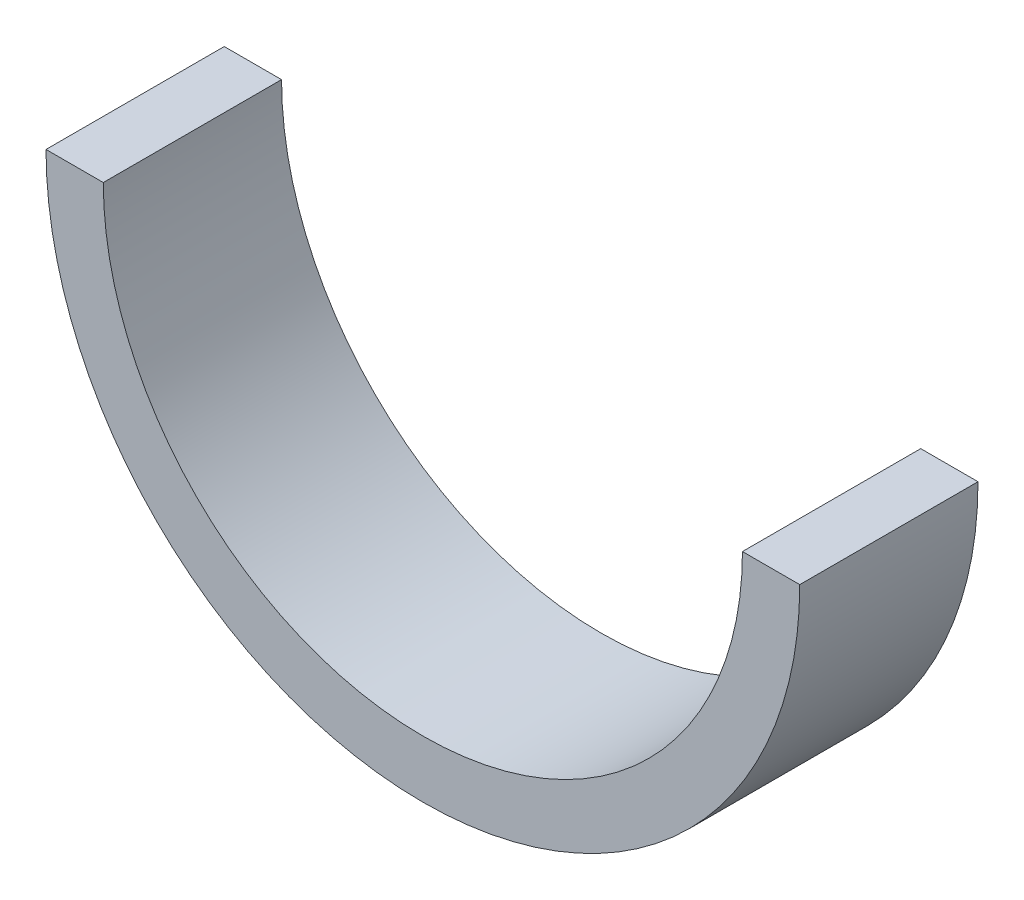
ISO-10303-21;
HEADER;
FILE_DESCRIPTION(('STEP AP214'),'2;1');
FILE_NAME('part.step','',(''),(''),'','','');
FILE_SCHEMA(('AUTOMOTIVE_DESIGN { 1 0 10303 214 1 1 1 1 }'));
ENDSEC;
DATA;
#1=APPLICATION_CONTEXT('core data for automotive mechanical design processes');
#2=APPLICATION_PROTOCOL_DEFINITION('international standard','automotive_design',2000,#1);
#3=PRODUCT_CONTEXT('',#1,'mechanical');
#4=PRODUCT('Part','Part','',(#3));
#5=PRODUCT_RELATED_PRODUCT_CATEGORY('part','',(#4));
#6=PRODUCT_DEFINITION_FORMATION('','',#4);
#7=PRODUCT_DEFINITION_CONTEXT('part definition',#1,'design');
#8=PRODUCT_DEFINITION('design','',#6,#7);
#9=PRODUCT_DEFINITION_SHAPE('','',#8);
#10=(LENGTH_UNIT() NAMED_UNIT(*) SI_UNIT(.MILLI.,.METRE.));
#11=(NAMED_UNIT(*) PLANE_ANGLE_UNIT() SI_UNIT($,.RADIAN.));
#12=(NAMED_UNIT(*) SI_UNIT($,.STERADIAN.) SOLID_ANGLE_UNIT());
#13=UNCERTAINTY_MEASURE_WITH_UNIT(LENGTH_MEASURE(1.E-05),#10,'distance_accuracy_value','');
#14=(GEOMETRIC_REPRESENTATION_CONTEXT(3) GLOBAL_UNCERTAINTY_ASSIGNED_CONTEXT((#13)) GLOBAL_UNIT_ASSIGNED_CONTEXT((#10,
#11,#12)) REPRESENTATION_CONTEXT('',''));
#15=CARTESIAN_POINT('',(0.,0.,0.));
#16=DIRECTION('',(0.,0.,1.));
#17=DIRECTION('',(1.,0.,0.));
#18=AXIS2_PLACEMENT_3D('',#15,#16,#17);
#19=CARTESIAN_POINT('',(0.,0.,0.));
#20=DIRECTION('',(0.,0.,-1.));
#21=DIRECTION('',(-1.,0.,0.));
#22=AXIS2_PLACEMENT_3D('',#19,#20,#21);
#23=CYLINDRICAL_SURFACE('',#22,12.55);
#24=CARTESIAN_POINT('',(0.,0.,0.));
#25=DIRECTION('',(0.,0.,1.));
#26=DIRECTION('',(-1.,0.,0.));
#27=AXIS2_PLACEMENT_3D('',#24,#25,#26);
#28=CIRCLE('',#27,12.55);
#29=CARTESIAN_POINT('',(-12.55,0.,0.));
#30=VERTEX_POINT('',#29);
#31=CARTESIAN_POINT('',(12.55,-3.423379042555E-13,0.));
#32=VERTEX_POINT('',#31);
#33=EDGE_CURVE('E105',#30,#32,#28,.T.);
#34=ORIENTED_EDGE('',*,*,#33,.F.);
#35=DIRECTION('',(0.,0.,1.));
#36=VECTOR('',#35,1.);
#37=CARTESIAN_POINT('',(-12.55,0.,0.));
#38=LINE('',#37,#36);
#39=CARTESIAN_POINT('',(-12.55,0.,7.));
#40=VERTEX_POINT('',#39);
#41=EDGE_CURVE('E10',#30,#40,#38,.T.);
#42=ORIENTED_EDGE('',*,*,#41,.T.);
#43=CARTESIAN_POINT('',(0.,0.,7.));
#44=DIRECTION('',(0.,0.,1.));
#45=DIRECTION('',(-1.,0.,0.));
#46=AXIS2_PLACEMENT_3D('',#43,#44,#45);
#47=CIRCLE('',#46,12.55);
#48=CARTESIAN_POINT('',(12.55,-3.423379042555E-13,7.));
#49=VERTEX_POINT('',#48);
#50=EDGE_CURVE('E24',#40,#49,#47,.T.);
#51=ORIENTED_EDGE('',*,*,#50,.T.);
#52=DIRECTION('',(0.,0.,-1.));
#53=VECTOR('',#52,1.);
#54=CARTESIAN_POINT('',(12.55,0.,0.));
#55=LINE('',#54,#53);
#56=EDGE_CURVE('E71',#49,#32,#55,.T.);
#57=ORIENTED_EDGE('',*,*,#56,.T.);
#58=EDGE_LOOP('',(#34,#42,#51,#57));
#59=FACE_BOUND('',#58,.T.);
#60=ADVANCED_FACE('F16',(#59),#23,.F.);
#61=CARTESIAN_POINT('',(20.,0.,0.));
#62=DIRECTION('',(0.,-1.,0.));
#63=DIRECTION('',(-1.,0.,0.));
#64=AXIS2_PLACEMENT_3D('',#61,#62,#63);
#65=PLANE('',#64);
#66=DIRECTION('',(0.,0.,1.));
#67=VECTOR('',#66,1.);
#68=CARTESIAN_POINT('',(-14.8,0.,0.));
#69=LINE('',#68,#67);
#70=CARTESIAN_POINT('',(-14.8,0.,0.));
#71=VERTEX_POINT('',#70);
#72=CARTESIAN_POINT('',(-14.8,0.,7.));
#73=VERTEX_POINT('',#72);
#74=EDGE_CURVE('E88',#71,#73,#69,.T.);
#75=ORIENTED_EDGE('',*,*,#74,.T.);
#76=DIRECTION('',(-1.,0.,0.));
#77=VECTOR('',#76,1.);
#78=CARTESIAN_POINT('',(20.,0.,7.));
#79=LINE('',#78,#77);
#80=EDGE_CURVE('E81',#40,#73,#79,.T.);
#81=ORIENTED_EDGE('',*,*,#80,.F.);
#82=ORIENTED_EDGE('',*,*,#41,.F.);
#83=DIRECTION('',(-1.,0.,0.));
#84=VECTOR('',#83,1.);
#85=CARTESIAN_POINT('',(20.,0.,0.));
#86=LINE('',#85,#84);
#87=EDGE_CURVE('E74',#30,#71,#86,.T.);
#88=ORIENTED_EDGE('',*,*,#87,.T.);
#89=EDGE_LOOP('',(#75,#81,#82,#88));
#90=FACE_BOUND('',#89,.T.);
#91=ADVANCED_FACE('F150',(#90),#65,.F.);
#92=CARTESIAN_POINT('',(0.,0.,7.));
#93=DIRECTION('',(0.,0.,1.));
#94=DIRECTION('',(1.,0.,0.));
#95=AXIS2_PLACEMENT_3D('',#92,#93,#94);
#96=PLANE('',#95);
#97=ORIENTED_EDGE('',*,*,#80,.T.);
#98=CARTESIAN_POINT('',(0.,0.,7.));
#99=DIRECTION('',(0.,0.,1.));
#100=DIRECTION('',(-1.,0.,0.));
#101=AXIS2_PLACEMENT_3D('',#98,#99,#100);
#102=CIRCLE('',#101,14.8);
#103=CARTESIAN_POINT('',(14.8,3.390523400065E-13,7.));
#104=VERTEX_POINT('',#103);
#105=EDGE_CURVE('E77',#73,#104,#102,.T.);
#106=ORIENTED_EDGE('',*,*,#105,.T.);
#107=DIRECTION('',(-1.,0.,0.));
#108=VECTOR('',#107,1.);
#109=CARTESIAN_POINT('',(20.,0.,7.));
#110=LINE('',#109,#108);
#111=EDGE_CURVE('E67',#104,#49,#110,.T.);
#112=ORIENTED_EDGE('',*,*,#111,.T.);
#113=ORIENTED_EDGE('',*,*,#50,.F.);
#114=EDGE_LOOP('',(#97,#106,#112,#113));
#115=FACE_BOUND('',#114,.T.);
#116=ADVANCED_FACE('F78',(#115),#96,.T.);
#117=CARTESIAN_POINT('',(20.,0.,0.));
#118=DIRECTION('',(0.,-1.,0.));
#119=DIRECTION('',(-1.,0.,0.));
#120=AXIS2_PLACEMENT_3D('',#117,#118,#119);
#121=PLANE('',#120);
#122=ORIENTED_EDGE('',*,*,#111,.F.);
#123=DIRECTION('',(0.,0.,-1.));
#124=VECTOR('',#123,1.);
#125=CARTESIAN_POINT('',(14.8,0.,0.));
#126=LINE('',#125,#124);
#127=CARTESIAN_POINT('',(14.8,3.390523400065E-13,0.));
#128=VERTEX_POINT('',#127);
#129=EDGE_CURVE('E75',#104,#128,#126,.T.);
#130=ORIENTED_EDGE('',*,*,#129,.T.);
#131=DIRECTION('',(-1.,0.,0.));
#132=VECTOR('',#131,1.);
#133=CARTESIAN_POINT('',(20.,0.,0.));
#134=LINE('',#133,#132);
#135=EDGE_CURVE('E106',#128,#32,#134,.T.);
#136=ORIENTED_EDGE('',*,*,#135,.T.);
#137=ORIENTED_EDGE('',*,*,#56,.F.);
#138=EDGE_LOOP('',(#122,#130,#136,#137));
#139=FACE_BOUND('',#138,.T.);
#140=ADVANCED_FACE('F69',(#139),#121,.F.);
#141=CARTESIAN_POINT('',(0.,0.,0.));
#142=DIRECTION('',(0.,0.,1.));
#143=DIRECTION('',(1.,0.,0.));
#144=AXIS2_PLACEMENT_3D('',#141,#142,#143);
#145=PLANE('',#144);
#146=ORIENTED_EDGE('',*,*,#33,.T.);
#147=ORIENTED_EDGE('',*,*,#135,.F.);
#148=CARTESIAN_POINT('',(0.,0.,0.));
#149=DIRECTION('',(0.,0.,1.));
#150=DIRECTION('',(-1.,0.,0.));
#151=AXIS2_PLACEMENT_3D('',#148,#149,#150);
#152=CIRCLE('',#151,14.8);
#153=EDGE_CURVE('E93',#71,#128,#152,.T.);
#154=ORIENTED_EDGE('',*,*,#153,.F.);
#155=ORIENTED_EDGE('',*,*,#87,.F.);
#156=EDGE_LOOP('',(#146,#147,#154,#155));
#157=FACE_BOUND('',#156,.T.);
#158=ADVANCED_FACE('F124',(#157),#145,.F.);
#159=CARTESIAN_POINT('',(0.,0.,0.));
#160=DIRECTION('',(0.,0.,-1.));
#161=DIRECTION('',(-1.,0.,0.));
#162=AXIS2_PLACEMENT_3D('',#159,#160,#161);
#163=CYLINDRICAL_SURFACE('',#162,14.8);
#164=ORIENTED_EDGE('',*,*,#129,.F.);
#165=ORIENTED_EDGE('',*,*,#105,.F.);
#166=ORIENTED_EDGE('',*,*,#74,.F.);
#167=ORIENTED_EDGE('',*,*,#153,.T.);
#168=EDGE_LOOP('',(#164,#165,#166,#167));
#169=FACE_BOUND('',#168,.T.);
#170=ADVANCED_FACE('F90',(#169),#163,.T.);
#171=CLOSED_SHELL('',(#60,#91,#116,#140,#158,#170));
#172=MANIFOLD_SOLID_BREP('B1',#171);
#173=ADVANCED_BREP_SHAPE_REPRESENTATION('',(#18,#172),#14);
#174=SHAPE_DEFINITION_REPRESENTATION(#9,#173);
ENDSEC;
END-ISO-10303-21;
